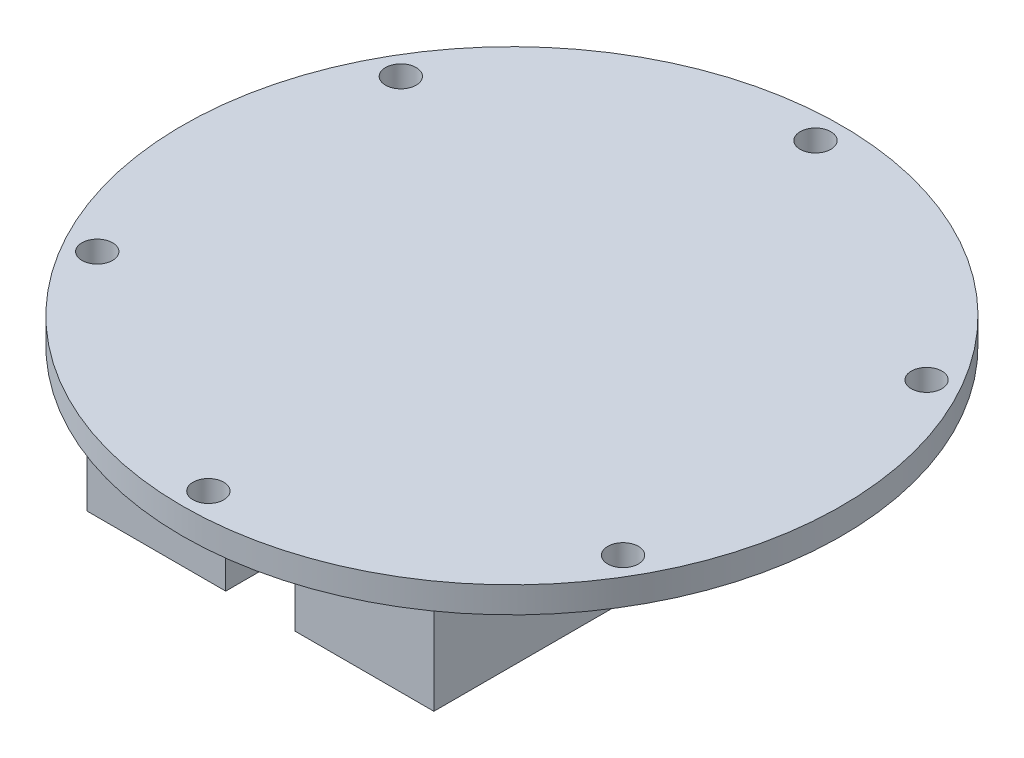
from build123d import *

# Parameters (mm, degrees)
SKETCH1_W                  = 60.325
SKETCH1_H                  = 4.7625
F_2_0_221_DIAMETER_HOLE1_D = 5.6134
SKETCH4_W                  = 25.4
SKETCH4_H                  = 92.075
EXTRUDE1_DEPTH             = 19.05


with BuildPart() as part:
    # Sketch1 → Revolve1 (revolve)
    with BuildSketch(Plane.XY, mode=Mode.PRIVATE) as revolve1_sk:
        with Locations((-30.1625, -154.78125)):
            Rectangle(SKETCH1_W, SKETCH1_H)
    revolve(revolve1_sk.sketch.rotate(Axis((0, 0, 0), (0, -1, 0)), 270), axis=Axis((0, 0, 0), (0, -1, 0)))

    # 2 _0.221_ Diameter Hole1 (through all)
    with Locations(Plane.XZ.offset(157.1625)):
        with Locations((0, 55.5625), (48.118536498, 27.78125), (48.118536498, -27.78125), (0, -55.5625), (-48.118536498, -27.78125), (-48.118536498, 27.78125)):
            Hole(F_2_0_221_DIAMETER_HOLE1_D / 2)

    # Sketch4 → Extrude1 (add)
    with BuildSketch(Plane.XZ.offset(157.1625)):
        with Locations((-19.05, 0)):
            Rectangle(SKETCH4_W, SKETCH4_H)
        with Locations((19.05, 0)):
            Rectangle(SKETCH4_W, SKETCH4_H)
    extrude(amount=EXTRUDE1_DEPTH)


solid = part.part
